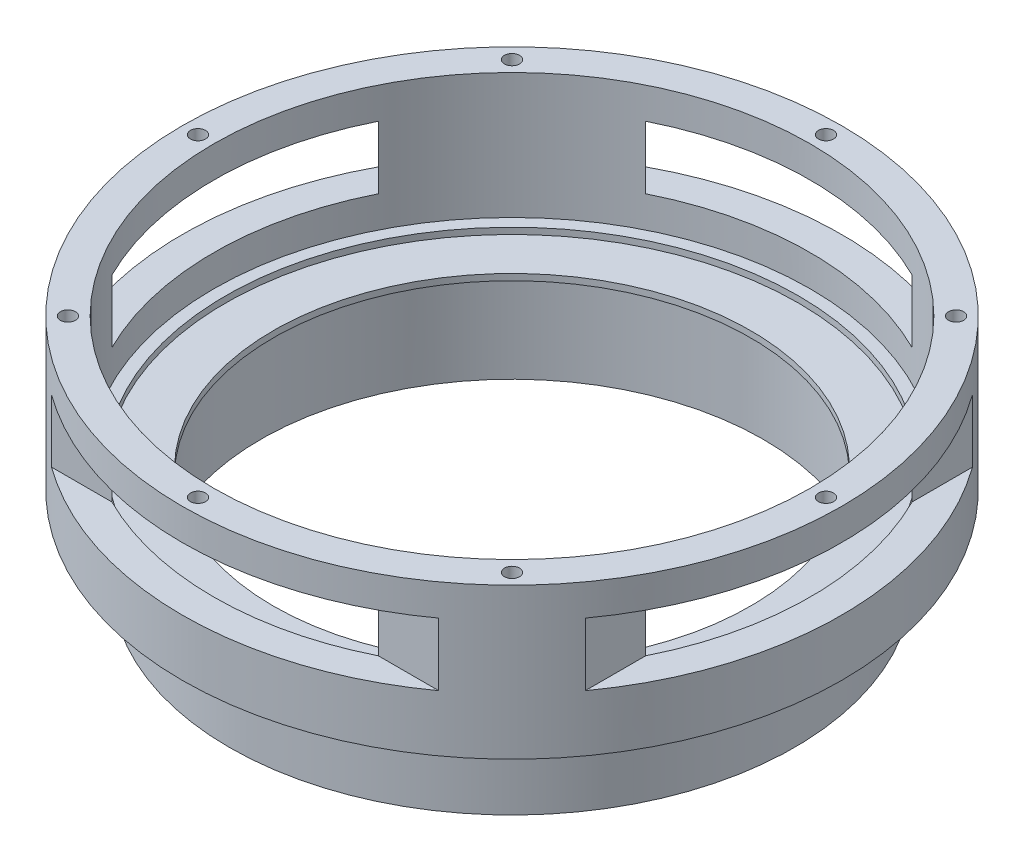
from build123d import *

# Parameters (mm, degrees)
SKETCH1_R                              = 66.675
EXTRUDE1_DEPTH                         = 46.99
SKETCH2_R                              = 60.325
EXTRUDE2_DEPTH                         = 25.4
SKETCH3_R                              = 48.26
EXTRUDE3_DEPTH                         = 106.352604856
SKETCH5_R                              = 50.8
EXTRUDE7_DEPTH                         = 19.05
SKETCH6_OUTSIDE_W                      = 174.22
SKETCH6_OUTSIDE_H                      = 174.22
SKETCH6_OUTSIDE_R                      = 57.15
EXTRUDE9_DEPTH                         = 16.51
EXTRUDE12_DEPTH                        = 106.352604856
EXTRUDE12_DEPTH_BACK                   = 106.352604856
SKETCH9_W                              = 12.7
SKETCH9_H                              = 12.7
EXTRUDE13_DEPTH                        = 106.352604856
EXTRUDE13_DEPTH_BACK                   = 106.352604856
SKETCH10_W                             = 12.7
SKETCH10_H                             = 12.7
CIRPATTERN3_COUNT                      = 8
SKETCH15_R                             = 57.912
EXTRUDE14_DEPTH                        = 1.27
TAP_DRILL_FOR_4_HELICOIL2_2_AT_2_COUNT = 2
TAP_DRILL_FOR_4_HELICOIL2_2_AT_2_PITCH = 28.612732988
TAP_DRILL_FOR_4_HELICOIL2_2_AT_3_COUNT = 2
TAP_DRILL_FOR_4_HELICOIL2_2_AT_3_PITCH = 27.027753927
CIRPATTERN4_COUNT                      = 8
TAP_DRILL_FOR_4_HELICOIL3_AT_2_COUNT   = 2
TAP_DRILL_FOR_4_HELICOIL3_AT_2_PITCH   = 61.416599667
CIRPATTERN5_COUNT                      = 8


with BuildPart() as part:
    # Sketch1 → Extrude1 (new body)
    with BuildSketch(Plane(origin=(0, 0, 0), x_dir=(1, 0, 0), z_dir=(0, 1, 0))):
        with Locations(Location((0, 0, 0), (0, 0, 270))):
            Circle(SKETCH1_R)
    extrude(amount=EXTRUDE1_DEPTH)

    # Sketch2 → Extrude2 (cut)
    with BuildSketch(Plane(origin=(0, 46.99, 0), x_dir=(1, 0, 0), z_dir=(0, 1, 0))):
        with Locations(Location((0, 0, 0), (0, 0, 270))):
            Circle(SKETCH2_R)
    extrude(amount=-EXTRUDE2_DEPTH, mode=Mode.SUBTRACT)

    # Sketch3 → Extrude3 (cut, through all)
    with BuildSketch(Plane.XZ):
        with Locations(Location((0, 0, 0), (0, 0, 270))):
            Circle(SKETCH3_R)
    extrude(amount=-EXTRUDE3_DEPTH, mode=Mode.SUBTRACT)

    # Sketch5 → Extrude7 (cut)
    with BuildSketch(Plane.XZ):
        with Locations(Location((0, 0, 0), (0, 0, 270))):
            Circle(SKETCH5_R)
    extrude(amount=-EXTRUDE7_DEPTH, mode=Mode.SUBTRACT)

    # Sketch6 outside → Extrude9 (cut)
    with BuildSketch(Plane.XZ):
        Rectangle(SKETCH6_OUTSIDE_W, SKETCH6_OUTSIDE_H)
        with Locations(Location((0, 0, 0), (0, 0, 270))):
            Circle(SKETCH6_OUTSIDE_R, mode=Mode.SUBTRACT)
    extrude(amount=-EXTRUDE9_DEPTH, mode=Mode.SUBTRACT)

    # Sketch9 → Extrude12 (cut, two sides: drawn at the far end of the back side and taken through both)
    with BuildSketch(Plane.XY.offset(-EXTRUDE12_DEPTH_BACK)):
        with Locations((60.325, 34.29)):
            Rectangle(SKETCH9_W, SKETCH9_H)
        with Locations((-60.325, 34.29)):
            Rectangle(SKETCH9_W, SKETCH9_H)
    extrude(amount=EXTRUDE12_DEPTH + EXTRUDE12_DEPTH_BACK, mode=Mode.SUBTRACT)

    # Sketch10 → Extrude13 (cut, two sides: drawn at the far end of the back side and taken through both)
    with BuildSketch(Plane(origin=(0, 0, 0), x_dir=(0, 0, -1), z_dir=(1, 0, 0)).offset(-EXTRUDE13_DEPTH_BACK)):
        with Locations((60.325, 34.29)):
            Rectangle(SKETCH10_W, SKETCH10_H)
        with Locations((-60.325, 34.29)):
            Rectangle(SKETCH10_W, SKETCH10_H)
    extrude(amount=EXTRUDE13_DEPTH + EXTRUDE13_DEPTH_BACK, mode=Mode.SUBTRACT)

    # Sketch14 → Tap Drill for _4 Helicoil2 (revolve, cut)
    with BuildSketch(Plane(origin=(-63.5, 46.99, 0), x_dir=(0, 0, 1), z_dir=(1, 0, 0))):
        Polygon((0, 0), (0, 10.059711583), (1.524, 9.144), (1.524, 0), align=None)
    tap_drill_for_4_helicoil2 = revolve(axis=Axis((-63.5, 53.34, 0), (0, -1, 0)), mode=Mode.SUBTRACT)

    # CirPattern3: Tap Drill for _4 Helicoil2 ×8 about axis
    cirpattern3_axis = Axis((0, 0, 0), (0, 1, 0))
    for i in range(1, CIRPATTERN3_COUNT):
        add(tap_drill_for_4_helicoil2.rotate(cirpattern3_axis, i * 360 / CIRPATTERN3_COUNT), mode=Mode.SUBTRACT)

    # Sketch15 → Extrude14 (cut)
    with BuildSketch(Plane(origin=(0, 21.59, 0), x_dir=(1, 0, 0), z_dir=(0, 1, 0))):
        with Locations(Location((0, 0, 0), (0, 0, 270))):
            Circle(SKETCH15_R)
    extrude(amount=-EXTRUDE14_DEPTH, mode=Mode.SUBTRACT)

    # Sketch17 → Tap Drill for _4 Helicoil2 2 (revolve, cut)
    with BuildSketch(Plane(origin=(-53.975, 0, 0), x_dir=(0, 0, -1), z_dir=(1, 0, 0))):
        Polygon((0, 0), (0, 10.059711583), (1.524, 9.144), (1.524, 0), align=None)
    tap_drill_for_4_helicoil2_2 = revolve(axis=Axis((-53.975, -6.35, 0), (0, 1, 0)), mode=Mode.SUBTRACT)

    # Tap Drill for _4 Helicoil2 2 at 2: Tap Drill for _4 Helicoil2 2 ×2
    with Locations(*[Vector(0.9997649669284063, 0, 0.021679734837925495) * (i * TAP_DRILL_FOR_4_HELICOIL2_2_AT_2_PITCH) for i in range(1, TAP_DRILL_FOR_4_HELICOIL2_2_AT_2_COUNT)]):
        add(tap_drill_for_4_helicoil2_2, mode=Mode.SUBTRACT)

    # Tap Drill for _4 Helicoil2 2 at 3: Tap Drill for _4 Helicoil2 2 ×2
    with Locations(*[Vector(0.9993825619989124, 0, 0.03513537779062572) * (i * TAP_DRILL_FOR_4_HELICOIL2_2_AT_3_PITCH) for i in range(1, TAP_DRILL_FOR_4_HELICOIL2_2_AT_3_COUNT)]):
        add(tap_drill_for_4_helicoil2_2, mode=Mode.SUBTRACT)

    # CirPattern4: Tap Drill for _4 Helicoil2 2 ×8 about axis
    cirpattern4_axis = Axis((0, 0, 0), (0, 1, 0))
    for i in range(1, CIRPATTERN4_COUNT):
        add(tap_drill_for_4_helicoil2_2.rotate(cirpattern4_axis, i * 360 / CIRPATTERN4_COUNT), mode=Mode.SUBTRACT)

    # CirPattern4 copy 1 sketch → CirPattern4 copy 1 (revolve, cut)
    with BuildSketch(Plane(origin=(-17.499956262, 0, 18.377216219), x_dir=(-0.7071067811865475, 0, -0.7071067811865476), z_dir=(0.7071067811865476, 0, -0.7071067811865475))):
        Polygon((0, 0), (0, 10.059711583), (1.524, 9.144), (1.524, 0), align=None)
    revolve(axis=Axis((-17.499956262, -6.35, 18.377216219), (0, 1, 0)), mode=Mode.SUBTRACT)

    # CirPattern4 copy 2 sketch → CirPattern4 copy 2 (revolve, cut)
    with BuildSketch(Plane(origin=(0.620316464, 0, 25.368991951), x_dir=(-1, 0, 0), z_dir=(0, 0, -1))):
        Polygon((0, 0), (0, 10.059711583), (1.524, 9.144), (1.524, 0), align=None)
    revolve(axis=Axis((0.620316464, -6.35, 25.368991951), (0, 1, 0)), mode=Mode.SUBTRACT)

    # CirPattern4 copy 3 sketch → CirPattern4 copy 3 (revolve, cut)
    with BuildSketch(Plane(origin=(18.377216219, 0, 17.499956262), x_dir=(-0.7071067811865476, 0, 0.7071067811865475), z_dir=(-0.7071067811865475, 0, -0.7071067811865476))):
        Polygon((0, 0), (0, 10.059711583), (1.524, 9.144), (1.524, 0), align=None)
    revolve(axis=Axis((18.377216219, -6.35, 17.499956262), (0, 1, 0)), mode=Mode.SUBTRACT)

    # CirPattern4 copy 4 sketch → CirPattern4 copy 4 (revolve, cut)
    with BuildSketch(Plane(origin=(25.368991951, 0, -0.620316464), x_dir=(0, 0, 1), z_dir=(-1, 0, 0))):
        Polygon((0, 0), (0, 10.059711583), (1.524, 9.144), (1.524, 0), align=None)
    revolve(axis=Axis((25.368991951, -6.35, -0.620316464), (0, 1, 0)), mode=Mode.SUBTRACT)

    # CirPattern4 copy 5 sketch → CirPattern4 copy 5 (revolve, cut)
    with BuildSketch(Plane(origin=(17.499956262, 0, -18.377216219), x_dir=(0.7071067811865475, 0, 0.7071067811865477), z_dir=(-0.7071067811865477, 0, 0.7071067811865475))):
        Polygon((0, 0), (0, 10.059711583), (1.524, 9.144), (1.524, 0), align=None)
    revolve(axis=Axis((17.499956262, -6.35, -18.377216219), (0, 1, 0)), mode=Mode.SUBTRACT)

    # CirPattern4 copy 6 sketch → CirPattern4 copy 6 (revolve, cut)
    with BuildSketch(Plane(origin=(-0.620316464, 0, -25.368991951), x_dir=(1, 0, 0), z_dir=(0, 0, 1))):
        Polygon((0, 0), (0, 10.059711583), (1.524, 9.144), (1.524, 0), align=None)
    revolve(axis=Axis((-0.620316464, -6.35, -25.368991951), (0, 1, 0)), mode=Mode.SUBTRACT)

    # CirPattern4 copy 7 sketch → CirPattern4 copy 7 (revolve, cut)
    with BuildSketch(Plane(origin=(-18.377216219, 0, -17.499956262), x_dir=(0.7071067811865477, 0, -0.7071067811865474), z_dir=(0.7071067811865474, 0, 0.7071067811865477))):
        Polygon((0, 0), (0, 10.059711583), (1.524, 9.144), (1.524, 0), align=None)
    revolve(axis=Axis((-18.377216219, -6.35, -17.499956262), (0, 1, 0)), mode=Mode.SUBTRACT)

    # CirPattern4 copy 8 sketch → CirPattern4 copy 8 (revolve, cut)
    with BuildSketch(Plane(origin=(-18.394890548, 0, 19.737870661), x_dir=(-0.7071067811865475, 0, -0.7071067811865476), z_dir=(0.7071067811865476, 0, -0.7071067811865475))):
        Polygon((0, 0), (0, 10.059711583), (1.524, 9.144), (1.524, 0), align=None)
    revolve(axis=Axis((-18.394890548, -6.35, 19.737870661), (0, 1, 0)), mode=Mode.SUBTRACT)

    # CirPattern4 copy 9 sketch → CirPattern4 copy 9 (revolve, cut)
    with BuildSketch(Plane(origin=(0.949630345, 0, 26.963934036), x_dir=(-1, 0, 0), z_dir=(0, 0, -1))):
        Polygon((0, 0), (0, 10.059711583), (1.524, 9.144), (1.524, 0), align=None)
    revolve(axis=Axis((0.949630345, -6.35, 26.963934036), (0, 1, 0)), mode=Mode.SUBTRACT)

    # CirPattern4 copy 10 sketch → CirPattern4 copy 10 (revolve, cut)
    with BuildSketch(Plane(origin=(19.737870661, 0, 18.394890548), x_dir=(-0.7071067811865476, 0, 0.7071067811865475), z_dir=(-0.7071067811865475, 0, -0.7071067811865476))):
        Polygon((0, 0), (0, 10.059711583), (1.524, 9.144), (1.524, 0), align=None)
    revolve(axis=Axis((19.737870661, -6.35, 18.394890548), (0, 1, 0)), mode=Mode.SUBTRACT)

    # CirPattern4 copy 11 sketch → CirPattern4 copy 11 (revolve, cut)
    with BuildSketch(Plane(origin=(26.963934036, 0, -0.949630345), x_dir=(0, 0, 1), z_dir=(-1, 0, 0))):
        Polygon((0, 0), (0, 10.059711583), (1.524, 9.144), (1.524, 0), align=None)
    revolve(axis=Axis((26.963934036, -6.35, -0.949630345), (0, 1, 0)), mode=Mode.SUBTRACT)

    # CirPattern4 copy 12 sketch → CirPattern4 copy 12 (revolve, cut)
    with BuildSketch(Plane(origin=(18.394890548, 0, -19.737870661), x_dir=(0.7071067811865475, 0, 0.7071067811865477), z_dir=(-0.7071067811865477, 0, 0.7071067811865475))):
        Polygon((0, 0), (0, 10.059711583), (1.524, 9.144), (1.524, 0), align=None)
    revolve(axis=Axis((18.394890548, -6.35, -19.737870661), (0, 1, 0)), mode=Mode.SUBTRACT)

    # CirPattern4 copy 13 sketch → CirPattern4 copy 13 (revolve, cut)
    with BuildSketch(Plane(origin=(-0.949630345, 0, -26.963934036), x_dir=(1, 0, 0), z_dir=(0, 0, 1))):
        Polygon((0, 0), (0, 10.059711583), (1.524, 9.144), (1.524, 0), align=None)
    revolve(axis=Axis((-0.949630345, -6.35, -26.963934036), (0, 1, 0)), mode=Mode.SUBTRACT)

    # CirPattern4 copy 14 sketch → CirPattern4 copy 14 (revolve, cut)
    with BuildSketch(Plane(origin=(-19.737870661, 0, -18.394890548), x_dir=(0.7071067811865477, 0, -0.7071067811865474), z_dir=(0.7071067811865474, 0, 0.7071067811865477))):
        Polygon((0, 0), (0, 10.059711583), (1.524, 9.144), (1.524, 0), align=None)
    revolve(axis=Axis((-19.737870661, -6.35, -18.394890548), (0, 1, 0)), mode=Mode.SUBTRACT)

    # Sketch18 → Tap Drill for _4 Helicoil3 (revolve, cut)
    with BuildSketch(Plane(origin=(-63.5, 16.51, 0), x_dir=(0, 0, -1), z_dir=(1, 0, 0))):
        Polygon((0, 0), (0, 10.059711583), (1.524, 9.144), (1.524, 0), align=None)
    tap_drill_for_4_helicoil3 = revolve(axis=Axis((-63.5, 10.16, 0), (0, 1, 0)), mode=Mode.SUBTRACT)

    # Tap Drill for _4 Helicoil3 at 2: Tap Drill for _4 Helicoil3 ×2
    with Locations(*[Vector(-0.18693563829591, 0, -0.9823721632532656) * (i * TAP_DRILL_FOR_4_HELICOIL3_AT_2_PITCH) for i in range(1, TAP_DRILL_FOR_4_HELICOIL3_AT_2_COUNT)]):
        add(tap_drill_for_4_helicoil3, mode=Mode.SUBTRACT)

    # CirPattern5: Tap Drill for _4 Helicoil3 ×8 about axis
    cirpattern5_axis = Axis((0, 0, 0), (0, 1, 0))
    for i in range(1, CIRPATTERN5_COUNT):
        add(tap_drill_for_4_helicoil3.rotate(cirpattern5_axis, i * 360 / CIRPATTERN5_COUNT), mode=Mode.SUBTRACT)

    # CirPattern5 copy 1 sketch → CirPattern5 copy 1 (revolve, cut)
    with BuildSketch(Plane(origin=(-95.682089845, 16.51, 10.356988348), x_dir=(-0.7071067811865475, 0, -0.7071067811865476), z_dir=(0.7071067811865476, 0, -0.7071067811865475))):
        Polygon((0, 0), (0, 10.059711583), (1.524, 9.144), (1.524, 0), align=None)
    revolve(axis=Axis((-95.682089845, 10.16, 10.356988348), (0, 1, 0)), mode=Mode.SUBTRACT)

    # CirPattern5 copy 2 sketch → CirPattern5 copy 2 (revolve, cut)
    with BuildSketch(Plane(origin=(-60.333957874, 16.51, 74.980951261), x_dir=(-1, 0, 0), z_dir=(0, 0, -1))):
        Polygon((0, 0), (0, 10.059711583), (1.524, 9.144), (1.524, 0), align=None)
    revolve(axis=Axis((-60.333957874, 10.16, 74.980951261), (0, 1, 0)), mode=Mode.SUBTRACT)

    # CirPattern5 copy 3 sketch → CirPattern5 copy 3 (revolve, cut)
    with BuildSketch(Plane(origin=(10.356988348, 16.51, 95.682089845), x_dir=(-0.7071067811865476, 0, 0.7071067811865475), z_dir=(-0.7071067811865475, 0, -0.7071067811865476))):
        Polygon((0, 0), (0, 10.059711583), (1.524, 9.144), (1.524, 0), align=None)
    revolve(axis=Axis((10.356988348, 10.16, 95.682089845), (0, 1, 0)), mode=Mode.SUBTRACT)

    # CirPattern5 copy 4 sketch → CirPattern5 copy 4 (revolve, cut)
    with BuildSketch(Plane(origin=(74.980951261, 16.51, 60.333957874), x_dir=(0, 0, 1), z_dir=(-1, 0, 0))):
        Polygon((0, 0), (0, 10.059711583), (1.524, 9.144), (1.524, 0), align=None)
    revolve(axis=Axis((74.980951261, 10.16, 60.333957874), (0, 1, 0)), mode=Mode.SUBTRACT)

    # CirPattern5 copy 5 sketch → CirPattern5 copy 5 (revolve, cut)
    with BuildSketch(Plane(origin=(95.682089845, 16.51, -10.356988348), x_dir=(0.7071067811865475, 0, 0.7071067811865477), z_dir=(-0.7071067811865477, 0, 0.7071067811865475))):
        Polygon((0, 0), (0, 10.059711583), (1.524, 9.144), (1.524, 0), align=None)
    revolve(axis=Axis((95.682089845, 10.16, -10.356988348), (0, 1, 0)), mode=Mode.SUBTRACT)

    # CirPattern5 copy 6 sketch → CirPattern5 copy 6 (revolve, cut)
    with BuildSketch(Plane(origin=(60.333957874, 16.51, -74.980951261), x_dir=(1, 0, 0), z_dir=(0, 0, 1))):
        Polygon((0, 0), (0, 10.059711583), (1.524, 9.144), (1.524, 0), align=None)
    revolve(axis=Axis((60.333957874, 10.16, -74.980951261), (0, 1, 0)), mode=Mode.SUBTRACT)

    # CirPattern5 copy 7 sketch → CirPattern5 copy 7 (revolve, cut)
    with BuildSketch(Plane(origin=(-10.356988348, 16.51, -95.682089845), x_dir=(0.7071067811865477, 0, -0.7071067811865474), z_dir=(0.7071067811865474, 0, 0.7071067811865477))):
        Polygon((0, 0), (0, 10.059711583), (1.524, 9.144), (1.524, 0), align=None)
    revolve(axis=Axis((-10.356988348, 10.16, -95.682089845), (0, 1, 0)), mode=Mode.SUBTRACT)


solid = part.part
